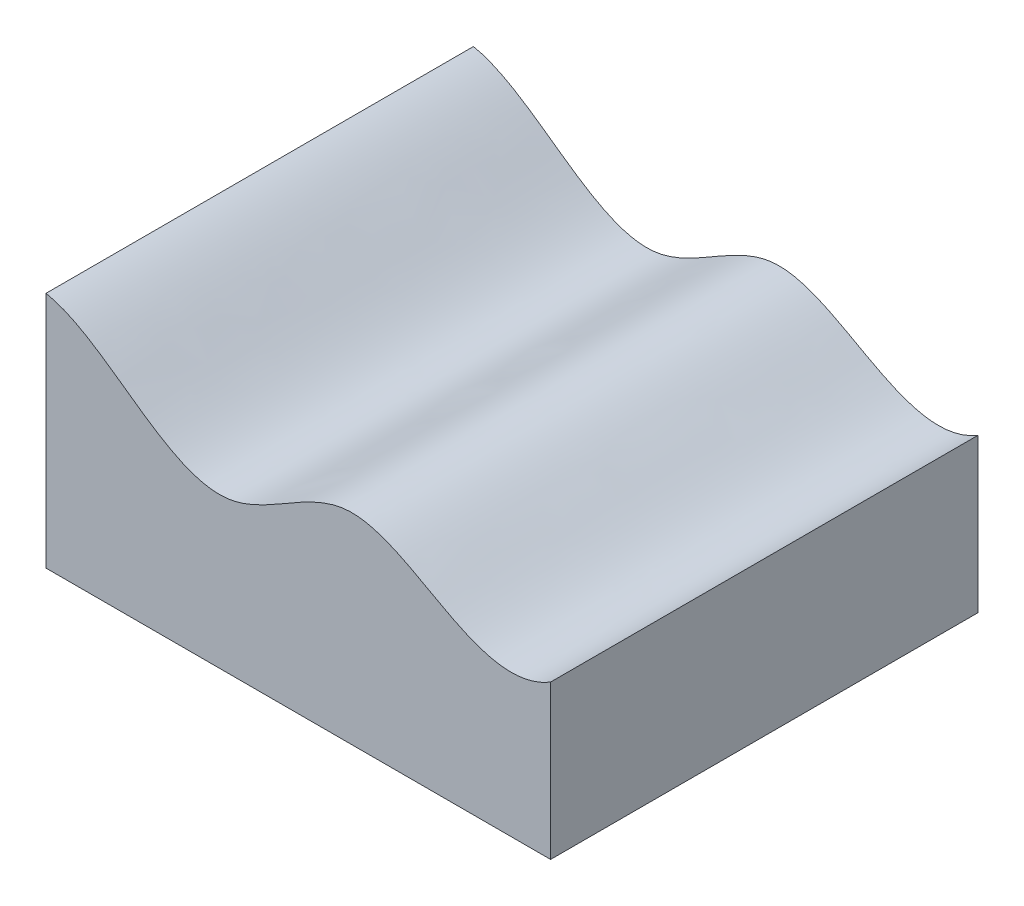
ISO-10303-21;
HEADER;
FILE_DESCRIPTION(('STEP AP214'),'2;1');
FILE_NAME('part.step','',(''),(''),'','','');
FILE_SCHEMA(('AUTOMOTIVE_DESIGN { 1 0 10303 214 1 1 1 1 }'));
ENDSEC;
DATA;
#1=APPLICATION_CONTEXT('core data for automotive mechanical design processes');
#2=APPLICATION_PROTOCOL_DEFINITION('international standard','automotive_design',2000,#1);
#3=PRODUCT_CONTEXT('',#1,'mechanical');
#4=PRODUCT('Part','Part','',(#3));
#5=PRODUCT_RELATED_PRODUCT_CATEGORY('part','',(#4));
#6=PRODUCT_DEFINITION_FORMATION('','',#4);
#7=PRODUCT_DEFINITION_CONTEXT('part definition',#1,'design');
#8=PRODUCT_DEFINITION('design','',#6,#7);
#9=PRODUCT_DEFINITION_SHAPE('','',#8);
#10=(LENGTH_UNIT() NAMED_UNIT(*) SI_UNIT(.MILLI.,.METRE.));
#11=(NAMED_UNIT(*) PLANE_ANGLE_UNIT() SI_UNIT($,.RADIAN.));
#12=(NAMED_UNIT(*) SI_UNIT($,.STERADIAN.) SOLID_ANGLE_UNIT());
#13=UNCERTAINTY_MEASURE_WITH_UNIT(LENGTH_MEASURE(1.E-05),#10,'distance_accuracy_value','');
#14=(GEOMETRIC_REPRESENTATION_CONTEXT(3) GLOBAL_UNCERTAINTY_ASSIGNED_CONTEXT((#13)) GLOBAL_UNIT_ASSIGNED_CONTEXT((#10,
#11,#12)) REPRESENTATION_CONTEXT('',''));
#15=CARTESIAN_POINT('',(0.,0.,0.));
#16=DIRECTION('',(0.,0.,1.));
#17=DIRECTION('',(1.,0.,0.));
#18=AXIS2_PLACEMENT_3D('',#15,#16,#17);
#19=CARTESIAN_POINT('',(94.7449071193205,40.132,80.2493362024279));
#20=DIRECTION('',(-1.,0.,0.));
#21=DIRECTION('',(0.,0.,1.));
#22=AXIS2_PLACEMENT_3D('',#19,#20,#21);
#23=PLANE('',#22);
#24=DIRECTION('',(0.,0.,-1.));
#25=VECTOR('',#24,1.);
#26=CARTESIAN_POINT('',(94.7449071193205,0.,80.2493362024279));
#27=LINE('',#26,#25);
#28=CARTESIAN_POINT('',(94.7449071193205,0.,80.2493362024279));
#29=VERTEX_POINT('',#28);
#30=CARTESIAN_POINT('',(94.7449071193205,0.,-80.2493362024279));
#31=VERTEX_POINT('',#30);
#32=EDGE_CURVE('E175',#29,#31,#27,.T.);
#33=ORIENTED_EDGE('',*,*,#32,.T.);
#34=DIRECTION('',(0.,-1.,0.));
#35=VECTOR('',#34,1.);
#36=CARTESIAN_POINT('',(94.7449071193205,40.132,-80.2493362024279));
#37=LINE('',#36,#35);
#38=CARTESIAN_POINT('',(94.7449071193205,57.7006263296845,-80.249336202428));
#39=VERTEX_POINT('',#38);
#40=EDGE_CURVE('E46',#39,#31,#37,.T.);
#41=ORIENTED_EDGE('',*,*,#40,.F.);
#42=DIRECTION('',(0.,0.,1.));
#43=VECTOR('',#42,1.);
#44=CARTESIAN_POINT('',(94.7449071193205,57.7006263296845,0.));
#45=LINE('',#44,#43);
#46=CARTESIAN_POINT('',(94.7449071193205,57.7006263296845,80.2493362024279));
#47=VERTEX_POINT('',#46);
#48=EDGE_CURVE('E186',#47,#39,#45,.F.);
#49=ORIENTED_EDGE('',*,*,#48,.F.);
#50=DIRECTION('',(0.,-1.,0.));
#51=VECTOR('',#50,1.);
#52=CARTESIAN_POINT('',(94.7449071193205,40.132,80.2493362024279));
#53=LINE('',#52,#51);
#54=EDGE_CURVE('E181',#47,#29,#53,.T.);
#55=ORIENTED_EDGE('',*,*,#54,.T.);
#56=EDGE_LOOP('',(#33,#41,#49,#55));
#57=FACE_BOUND('',#56,.T.);
#58=ADVANCED_FACE('F115',(#57),#23,.F.);
#59=CARTESIAN_POINT('',(-94.7449071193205,40.132,-80.2493362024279));
#60=DIRECTION('',(0.,0.,1.));
#61=DIRECTION('',(1.,0.,0.));
#62=AXIS2_PLACEMENT_3D('',#59,#60,#61);
#63=PLANE('',#62);
#64=DIRECTION('',(-1.,0.,0.));
#65=VECTOR('',#64,1.);
#66=CARTESIAN_POINT('',(-94.7449071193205,0.,-80.2493362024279));
#67=LINE('',#66,#65);
#68=CARTESIAN_POINT('',(-94.7449071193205,0.,-80.2493362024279));
#69=VERTEX_POINT('',#68);
#70=EDGE_CURVE('E172',#31,#69,#67,.T.);
#71=ORIENTED_EDGE('',*,*,#70,.T.);
#72=DIRECTION('',(0.,-1.,0.));
#73=VECTOR('',#72,1.);
#74=CARTESIAN_POINT('',(-94.7449071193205,40.132,-80.2493362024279));
#75=LINE('',#74,#73);
#76=CARTESIAN_POINT('',(-94.7449071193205,89.3816138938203,-80.2493362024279));
#77=VERTEX_POINT('',#76);
#78=EDGE_CURVE('E131',#77,#69,#75,.T.);
#79=ORIENTED_EDGE('',*,*,#78,.F.);
#80=CARTESIAN_POINT('',(94.7449071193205,57.7006263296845,-80.249336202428));
#81=CARTESIAN_POINT('',(94.3993574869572,57.4917980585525,-80.2493362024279));
#82=CARTESIAN_POINT('',(94.0500610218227,57.2891178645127,-80.2493362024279));
#83=CARTESIAN_POINT('',(93.3438109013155,56.8967130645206,-80.2493362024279));
#84=CARTESIAN_POINT('',(92.9868499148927,56.7070016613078,-80.2493362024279));
#85=CARTESIAN_POINT('',(92.2656378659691,56.3415335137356,-80.2493362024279));
#86=CARTESIAN_POINT('',(91.9013835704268,56.1657831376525,-80.2493362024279));
#87=CARTESIAN_POINT('',(91.1660197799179,55.8291502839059,-80.2493362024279));
#88=CARTESIAN_POINT('',(90.794909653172,55.6682691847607,-80.2493362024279));
#89=CARTESIAN_POINT('',(90.0480946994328,55.3629205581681,-80.2493362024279));
#90=CARTESIAN_POINT('',(89.6724209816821,55.2183770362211,-80.2493362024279));
#91=CARTESIAN_POINT('',(88.915323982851,54.9455377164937,-80.2493362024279));
#92=CARTESIAN_POINT('',(88.533902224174,54.8172376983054,-80.2493362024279));
#93=CARTESIAN_POINT('',(87.7658892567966,54.5774577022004,-80.2493362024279));
#94=CARTESIAN_POINT('',(87.3792991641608,54.4659741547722,-80.2493362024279));
#95=CARTESIAN_POINT('',(86.6015900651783,54.260262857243,-80.2493362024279));
#96=CARTESIAN_POINT('',(86.2104713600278,54.166033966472,-80.2493362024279));
#97=CARTESIAN_POINT('',(85.2904999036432,53.9660281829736,-80.2493362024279));
#98=CARTESIAN_POINT('',(84.7601091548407,53.8672498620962,-80.2493362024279));
#99=CARTESIAN_POINT('',(83.6942942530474,53.7015451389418,-80.2493362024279));
#100=CARTESIAN_POINT('',(83.1588691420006,53.63462492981,-80.2493362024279));
#101=CARTESIAN_POINT('',(82.0850421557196,53.5323827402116,-80.2493362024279));
#102=CARTESIAN_POINT('',(81.5466404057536,53.4970594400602,-80.2493362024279));
#103=CARTESIAN_POINT('',(80.4689905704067,53.4572099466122,-80.2493362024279));
#104=CARTESIAN_POINT('',(79.929743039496,53.4526684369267,-80.2493362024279));
#105=CARTESIAN_POINT('',(78.8518225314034,53.4730750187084,-80.2493362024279));
#106=CARTESIAN_POINT('',(78.3131495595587,53.4980233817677,-80.2493362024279));
#107=CARTESIAN_POINT('',(77.237844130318,53.5757752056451,-80.2493362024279));
#108=CARTESIAN_POINT('',(76.7012117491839,53.628579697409,-80.2493362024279));
#109=CARTESIAN_POINT('',(75.3812974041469,53.7909088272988,-80.2493362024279));
#110=CARTESIAN_POINT('',(74.5998360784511,53.9154048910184,-80.2493362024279));
#111=CARTESIAN_POINT('',(73.0461939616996,54.2139366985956,-80.2493362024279));
#112=CARTESIAN_POINT('',(72.2740183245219,54.38799874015,-80.2493362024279));
#113=CARTESIAN_POINT('',(70.7405489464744,54.7791104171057,-80.2493362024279));
#114=CARTESIAN_POINT('',(69.9792576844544,54.9961696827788,-80.2493362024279));
#115=CARTESIAN_POINT('',(68.464937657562,55.4680067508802,-80.2493362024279));
#116=CARTESIAN_POINT('',(67.7119589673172,55.722943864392,-80.2493362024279));
#117=CARTESIAN_POINT('',(66.2176143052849,56.2639200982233,-80.2493362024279));
#118=CARTESIAN_POINT('',(65.476244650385,56.5499491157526,-80.2493362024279));
#119=CARTESIAN_POINT('',(64.0042072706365,57.1479001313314,-80.2493362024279));
#120=CARTESIAN_POINT('',(63.273538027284,57.4598184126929,-80.2493362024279));
#121=CARTESIAN_POINT('',(61.8833356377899,58.0775356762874,-80.2493362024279));
#122=CARTESIAN_POINT('',(61.2230298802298,58.3816057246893,-80.2493362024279));
#123=CARTESIAN_POINT('',(59.9093371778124,59.0043792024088,-80.2493362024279));
#124=CARTESIAN_POINT('',(59.2559505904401,59.3230833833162,-80.2493362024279));
#125=CARTESIAN_POINT('',(57.9547952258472,59.972334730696,-80.2493362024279));
#126=CARTESIAN_POINT('',(57.3070287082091,60.3028864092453,-80.2493362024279));
#127=CARTESIAN_POINT('',(56.0162044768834,60.9730768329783,-80.2493362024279));
#128=CARTESIAN_POINT('',(55.3731468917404,61.3127158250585,-80.2493362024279));
#129=CARTESIAN_POINT('',(53.4487025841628,62.341834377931,-80.2493362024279));
#130=CARTESIAN_POINT('',(52.1726347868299,63.0412152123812,-80.2493362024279));
#131=CARTESIAN_POINT('',(49.6264324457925,64.4472288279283,-80.2493362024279));
#132=CARTESIAN_POINT('',(48.3562928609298,65.1538526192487,-80.2493362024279));
#133=CARTESIAN_POINT('',(46.4473267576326,66.206243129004,-80.2493362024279));
#134=CARTESIAN_POINT('',(45.8105447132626,66.5556925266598,-80.2493362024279));
#135=CARTESIAN_POINT('',(44.5343712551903,67.2497844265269,-80.2493362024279));
#136=CARTESIAN_POINT('',(43.8949798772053,67.594426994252,-80.2493362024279));
#137=CARTESIAN_POINT('',(42.6124840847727,68.276341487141,-80.2493362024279));
#138=CARTESIAN_POINT('',(41.9693807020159,68.6136153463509,-80.2493362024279));
#139=CARTESIAN_POINT('',(40.6780481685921,69.2781847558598,-80.2493362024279));
#140=CARTESIAN_POINT('',(40.0298191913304,69.6054806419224,-80.2493362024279));
#141=CARTESIAN_POINT('',(38.7376149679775,70.2418874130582,-80.2493362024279));
#142=CARTESIAN_POINT('',(38.0937434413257,70.5512081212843,-80.2493362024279));
#143=CARTESIAN_POINT('',(36.7985680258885,71.1542034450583,-80.2493362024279));
#144=CARTESIAN_POINT('',(36.1472630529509,71.4478757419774,-80.2493362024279));
#145=CARTESIAN_POINT('',(34.8361026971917,72.0160044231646,-80.2493362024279));
#146=CARTESIAN_POINT('',(34.1762453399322,72.2904562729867,-80.2493362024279));
#147=CARTESIAN_POINT('',(32.8471130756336,72.816033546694,-80.2493362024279));
#148=CARTESIAN_POINT('',(32.1778365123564,73.0671548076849,-80.2493362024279));
#149=CARTESIAN_POINT('',(30.8294724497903,73.5413367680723,-80.2493362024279));
#150=CARTESIAN_POINT('',(30.1503865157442,73.7644018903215,-80.2493362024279));
#151=CARTESIAN_POINT('',(28.7822518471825,74.1772514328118,-80.2493362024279));
#152=CARTESIAN_POINT('',(28.0932058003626,74.3670446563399,-80.2493362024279));
#153=CARTESIAN_POINT('',(26.8813036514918,74.6645021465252,-80.2493362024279));
#154=CARTESIAN_POINT('',(26.360564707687,74.7807921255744,-80.2493362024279));
#155=CARTESIAN_POINT('',(25.3142051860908,74.989111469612,-80.2493362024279));
#156=CARTESIAN_POINT('',(24.7885845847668,75.0811407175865,-80.2493362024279));
#157=CARTESIAN_POINT('',(23.7332369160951,75.238378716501,-80.2493362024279));
#158=CARTESIAN_POINT('',(23.2035092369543,75.3035833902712,-80.2493362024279));
#159=CARTESIAN_POINT('',(22.1435577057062,75.4044261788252,-80.2493362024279));
#160=CARTESIAN_POINT('',(21.6133466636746,75.4401951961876,-80.2493362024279));
#161=CARTESIAN_POINT('',(20.8172090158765,75.4703608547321,-80.2493362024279));
#162=CARTESIAN_POINT('',(20.5516886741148,75.4765013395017,-80.2493362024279));
#163=CARTESIAN_POINT('',(20.020574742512,75.4807139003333,-80.2493362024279));
#164=CARTESIAN_POINT('',(19.7549811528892,75.4787860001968,-80.2493362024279));
#165=CARTESIAN_POINT('',(19.2241155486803,75.4666456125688,-80.2493362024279));
#166=CARTESIAN_POINT('',(18.9588434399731,75.456437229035,-80.2493362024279));
#167=CARTESIAN_POINT('',(18.4287494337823,75.4275622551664,-80.2493362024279));
#168=CARTESIAN_POINT('',(18.1639275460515,75.4088954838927,-80.2493362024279));
#169=CARTESIAN_POINT('',(17.700865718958,75.3686697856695,-80.2493362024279));
#170=CARTESIAN_POINT('',(17.5024611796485,75.3489874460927,-80.2493362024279));
#171=CARTESIAN_POINT('',(17.1061946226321,75.3047498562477,-80.2493362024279));
#172=CARTESIAN_POINT('',(16.9083326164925,75.2801945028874,-80.2493362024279));
#173=CARTESIAN_POINT('',(16.3156724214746,75.1995141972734,-80.2493362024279));
#174=CARTESIAN_POINT('',(15.9218119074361,75.136376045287,-80.2493362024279));
#175=CARTESIAN_POINT('',(15.1371080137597,74.9928907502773,-80.2493362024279));
#176=CARTESIAN_POINT('',(14.7462659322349,74.9125365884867,-80.2493362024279));
#177=CARTESIAN_POINT('',(13.9681654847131,74.7361714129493,-80.2493362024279));
#178=CARTESIAN_POINT('',(13.5809070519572,74.6401606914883,-80.2493362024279));
#179=CARTESIAN_POINT('',(12.4212253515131,74.3299125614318,-80.2493362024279));
#180=CARTESIAN_POINT('',(11.6545167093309,74.0941474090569,-80.2493362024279));
#181=CARTESIAN_POINT('',(10.1371760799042,73.5767148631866,-80.2493362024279));
#182=CARTESIAN_POINT('',(9.38654207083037,73.2950532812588,-80.2493362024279));
#183=CARTESIAN_POINT('',(8.01585590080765,72.7420769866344,-80.2493362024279));
#184=CARTESIAN_POINT('',(7.39367556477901,72.4759840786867,-80.2493362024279));
#185=CARTESIAN_POINT('',(6.15866031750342,71.9227391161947,-80.2493362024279));
#186=CARTESIAN_POINT('',(5.54582717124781,71.6355831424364,-80.2493362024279));
#187=CARTESIAN_POINT('',(4.32810710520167,71.0444158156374,-80.2493362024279));
#188=CARTESIAN_POINT('',(3.72322324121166,70.7403982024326,-80.2493362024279));
#189=CARTESIAN_POINT('',(2.52019236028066,70.1193047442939,-80.2493362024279));
#190=CARTESIAN_POINT('',(1.9220456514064,69.8022283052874,-80.2493362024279));
#191=CARTESIAN_POINT('',(0.731014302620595,69.1582943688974,-80.2493362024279));
#192=CARTESIAN_POINT('',(0.138129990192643,68.8314362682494,-80.2493362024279));
#193=CARTESIAN_POINT('',(-1.04363947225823,68.1710251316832,-80.2493362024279));
#194=CARTESIAN_POINT('',(-1.63252582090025,67.8374742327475,-80.2493362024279));
#195=CARTESIAN_POINT('',(-2.80790809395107,67.1663596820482,-80.2493362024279));
#196=CARTESIAN_POINT('',(-3.39440428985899,66.828796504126,-80.2493362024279));
#197=CARTESIAN_POINT('',(-4.5665571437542,66.1522398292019,-80.2493362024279));
#198=CARTESIAN_POINT('',(-5.15221381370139,65.8132463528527,-80.2493362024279));
#199=CARTESIAN_POINT('',(-6.27893378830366,65.1625398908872,-80.2493362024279));
#200=CARTESIAN_POINT('',(-6.81994789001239,64.8507419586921,-80.2493362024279));
#201=CARTESIAN_POINT('',(-7.90374103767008,64.2301710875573,-80.2493362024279));
#202=CARTESIAN_POINT('',(-8.44652015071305,63.9213982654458,-80.2493362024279));
#203=CARTESIAN_POINT('',(-9.53506040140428,63.3090206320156,-80.2493362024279));
#204=CARTESIAN_POINT('',(-10.0808218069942,63.0054162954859,-80.2493362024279));
#205=CARTESIAN_POINT('',(-11.1766166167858,62.4056458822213,-80.2493362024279));
#206=CARTESIAN_POINT('',(-11.7266511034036,62.109481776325,-80.2493362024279));
#207=CARTESIAN_POINT('',(-12.8319648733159,61.5272713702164,-80.2493362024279));
#208=CARTESIAN_POINT('',(-13.3872433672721,61.2412235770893,-80.2493362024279));
#209=CARTESIAN_POINT('',(-14.5042872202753,60.6820719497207,-80.2493362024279));
#210=CARTESIAN_POINT('',(-15.0660523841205,60.408967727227,-80.2493362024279));
#211=CARTESIAN_POINT('',(-16.1970504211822,59.8790338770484,-80.2493362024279));
#212=CARTESIAN_POINT('',(-16.766281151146,59.622199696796,-80.2493362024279));
#213=CARTESIAN_POINT('',(-17.9133690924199,59.1284798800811,-80.2493362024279));
#214=CARTESIAN_POINT('',(-18.4912260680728,58.8915936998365,-80.2493362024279));
#215=CARTESIAN_POINT('',(-19.5782050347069,58.4722684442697,-80.2493362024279));
#216=CARTESIAN_POINT('',(-20.0861488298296,58.2867883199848,-80.2493362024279));
#217=CARTESIAN_POINT('',(-21.1093657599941,57.93727256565,-80.2493362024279));
#218=CARTESIAN_POINT('',(-21.6246384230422,57.7732355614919,-80.2493362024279));
#219=CARTESIAN_POINT('',(-22.6625683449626,57.470175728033,-80.2493362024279));
#220=CARTESIAN_POINT('',(-23.1852253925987,57.3311521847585,-80.2493362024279));
#221=CARTESIAN_POINT('',(-23.9730667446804,57.1446335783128,-80.2493362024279));
#222=CARTESIAN_POINT('',(-24.2356975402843,57.086242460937,-80.2493362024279));
#223=CARTESIAN_POINT('',(-24.7625581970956,56.9771365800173,-80.2493362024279));
#224=CARTESIAN_POINT('',(-25.0267880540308,56.9264217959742,-80.2493362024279));
#225=CARTESIAN_POINT('',(-25.5566877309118,56.8331673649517,-80.2493362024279));
#226=CARTESIAN_POINT('',(-25.8223575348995,56.7906276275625,-80.2493362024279));
#227=CARTESIAN_POINT('',(-26.3549513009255,56.7142901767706,-80.2493362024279));
#228=CARTESIAN_POINT('',(-26.6218752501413,56.6804923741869,-80.2493362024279));
#229=CARTESIAN_POINT('',(-27.1566439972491,56.6218239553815,-80.2493362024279));
#230=CARTESIAN_POINT('',(-27.4244885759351,56.596951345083,-80.2493362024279));
#231=CARTESIAN_POINT('',(-27.9608423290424,56.556013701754,-80.2493362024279));
#232=CARTESIAN_POINT('',(-28.2293515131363,56.5399487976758,-80.2493362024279));
#233=CARTESIAN_POINT('',(-29.0383274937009,56.5047120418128,-80.2493362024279));
#234=CARTESIAN_POINT('',(-29.5794275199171,56.4988049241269,-80.2493362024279));
#235=CARTESIAN_POINT('',(-30.6610772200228,56.5209209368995,-80.2493362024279));
#236=CARTESIAN_POINT('',(-31.201626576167,56.5489580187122,-80.2493362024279));
#237=CARTESIAN_POINT('',(-32.2801140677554,56.6371125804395,-80.2493362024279));
#238=CARTESIAN_POINT('',(-32.818052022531,56.6972322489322,-80.2493362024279));
#239=CARTESIAN_POINT('',(-33.8921825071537,56.847676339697,-80.2493362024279));
#240=CARTESIAN_POINT('',(-34.4283554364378,56.9381392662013,-80.2493362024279));
#241=CARTESIAN_POINT('',(-35.4951609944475,57.1467266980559,-80.2493362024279));
#242=CARTESIAN_POINT('',(-36.0257945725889,57.2648463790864,-80.2493362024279));
#243=CARTESIAN_POINT('',(-37.0807402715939,57.5262289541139,-80.2493362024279));
#244=CARTESIAN_POINT('',(-37.6050528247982,57.6694901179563,-80.2493362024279));
#245=CARTESIAN_POINT('',(-38.9441273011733,58.0669051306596,-80.2493362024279));
#246=CARTESIAN_POINT('',(-39.7539696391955,58.3377006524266,-80.2493362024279));
#247=CARTESIAN_POINT('',(-41.3568722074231,58.926506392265,-80.2493362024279));
#248=CARTESIAN_POINT('',(-42.149917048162,59.2445579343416,-80.2493362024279));
#249=CARTESIAN_POINT('',(-43.7199616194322,59.9202077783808,-80.2493362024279));
#250=CARTESIAN_POINT('',(-44.4969416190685,60.2778516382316,-80.2493362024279));
#251=CARTESIAN_POINT('',(-46.0351957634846,61.0256407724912,-80.2493362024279));
#252=CARTESIAN_POINT('',(-46.7964666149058,61.4157927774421,-80.2493362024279));
#253=CARTESIAN_POINT('',(-48.3109118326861,62.226081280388,-80.2493362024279));
#254=CARTESIAN_POINT('',(-49.0639672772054,62.6464389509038,-80.2493362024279));
#255=CARTESIAN_POINT('',(-50.5566040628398,63.508831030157,-80.2493362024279));
#256=CARTESIAN_POINT('',(-51.2961968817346,63.9508456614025,-80.2493362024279));
#257=CARTESIAN_POINT('',(-52.7640616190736,64.8523999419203,-80.2493362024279));
#258=CARTESIAN_POINT('',(-53.4923391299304,65.3119305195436,-80.2493362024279));
#259=CARTESIAN_POINT('',(-54.9394355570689,66.244824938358,-80.2493362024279));
#260=CARTESIAN_POINT('',(-55.658259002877,66.7181817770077,-80.2493362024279));
#261=CARTESIAN_POINT('',(-57.2492099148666,67.7832254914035,-80.2493362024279));
#262=CARTESIAN_POINT('',(-58.1195214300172,68.3776180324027,-80.2493362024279));
#263=CARTESIAN_POINT('',(-59.852309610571,69.5772943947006,-80.2493362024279));
#264=CARTESIAN_POINT('',(-60.7147878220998,70.1825759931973,-80.2493362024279));
#265=CARTESIAN_POINT('',(-62.4355889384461,71.3996652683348,-80.2493362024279));
#266=CARTESIAN_POINT('',(-63.2939101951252,72.0114752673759,-80.2493362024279));
#267=CARTESIAN_POINT('',(-65.0099265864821,73.2374517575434,-80.2493362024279));
#268=CARTESIAN_POINT('',(-65.867620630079,73.8516197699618,-80.2493362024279));
#269=CARTESIAN_POINT('',(-67.5858982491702,75.0781638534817,-80.2493362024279));
#270=CARTESIAN_POINT('',(-68.4464840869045,75.6905367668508,-80.2493362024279));
#271=CARTESIAN_POINT('',(-70.1741770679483,76.9091809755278,-80.2493362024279));
#272=CARTESIAN_POINT('',(-71.0412928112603,77.5154401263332,-80.2493362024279));
#273=CARTESIAN_POINT('',(-72.7676340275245,78.7045787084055,-80.2493362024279));
#274=CARTESIAN_POINT('',(-73.6267037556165,79.2876833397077,-80.2493362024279));
#275=CARTESIAN_POINT('',(-75.3564559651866,80.4370203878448,-80.2493362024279));
#276=CARTESIAN_POINT('',(-76.2271416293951,81.0032480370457,-80.2493362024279));
#277=CARTESIAN_POINT('',(-77.9822796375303,82.1117818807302,-80.2493362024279));
#278=CARTESIAN_POINT('',(-78.8667149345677,82.6541149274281,-80.2493362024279));
#279=CARTESIAN_POINT('',(-80.6520100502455,83.7070018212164,-80.2493362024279));
#280=CARTESIAN_POINT('',(-81.5528328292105,84.2176180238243,-80.2493362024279));
#281=CARTESIAN_POINT('',(-83.3741557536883,85.1980938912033,-80.2493362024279));
#282=CARTESIAN_POINT('',(-84.2946122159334,85.6680342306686,-80.2493362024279));
#283=CARTESIAN_POINT('',(-86.1595930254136,86.5567936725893,-80.2493362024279));
#284=CARTESIAN_POINT('',(-87.1041018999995,86.9756446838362,-80.2493362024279));
#285=CARTESIAN_POINT('',(-88.3301808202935,87.4702808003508,-80.2493362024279));
#286=CARTESIAN_POINT('',(-88.5997697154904,87.5760664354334,-80.2493362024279));
#287=CARTESIAN_POINT('',(-89.1411173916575,87.7821912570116,-80.2493362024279));
#288=CARTESIAN_POINT('',(-89.4128767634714,87.8825288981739,-80.2493362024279));
#289=CARTESIAN_POINT('',(-89.9585070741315,88.0773626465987,-80.2493362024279));
#290=CARTESIAN_POINT('',(-90.232378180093,88.1718582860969,-80.2493362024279));
#291=CARTESIAN_POINT('',(-90.7821855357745,88.3546068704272,-80.2493362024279));
#292=CARTESIAN_POINT('',(-91.058121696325,88.4428600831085,-80.2493362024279));
#293=CARTESIAN_POINT('',(-91.6151986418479,88.6136939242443,-80.2493362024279));
#294=CARTESIAN_POINT('',(-91.8963628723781,88.6961982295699,-80.2493362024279));
#295=CARTESIAN_POINT('',(-92.4607188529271,88.8539784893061,-80.2493362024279));
#296=CARTESIAN_POINT('',(-92.7439106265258,88.9292543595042,-80.2493362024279));
#297=CARTESIAN_POINT('',(-93.3122874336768,89.0721460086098,-80.2493362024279));
#298=CARTESIAN_POINT('',(-93.5974728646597,89.139760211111,-80.2493362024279));
#299=CARTESIAN_POINT('',(-94.169794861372,89.2668894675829,-80.2493362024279));
#300=CARTESIAN_POINT('',(-94.4569323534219,89.3264003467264,-80.2493362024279));
#301=CARTESIAN_POINT('',(-94.7449071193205,89.3816138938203,-80.2493362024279));
#302=B_SPLINE_CURVE_WITH_KNOTS('',3,(#80,#81,#82,#83,#84,#85,#86,#87,#88,#89,#90,#91,#92,#93,
#94,#95,#96,#97,#98,#99,#100,#101,#102,#103,#104,#105,#106,#107,#108,#109,#110,#111,#112,#113,
#114,#115,#116,#117,#118,#119,#120,#121,#122,#123,#124,#125,#126,#127,#128,#129,#130,#131,#132,
#133,#134,#135,#136,#137,#138,#139,#140,#141,#142,#143,#144,#145,#146,#147,#148,#149,#150,#151,
#152,#153,#154,#155,#156,#157,#158,#159,#160,#161,#162,#163,#164,#165,#166,#167,#168,#169,#170,
#171,#172,#173,#174,#175,#176,#177,#178,#179,#180,#181,#182,#183,#184,#185,#186,#187,#188,#189,
#190,#191,#192,#193,#194,#195,#196,#197,#198,#199,#200,#201,#202,#203,#204,#205,#206,#207,#208,
#209,#210,#211,#212,#213,#214,#215,#216,#217,#218,#219,#220,#221,#222,#223,#224,#225,#226,#227,
#228,#229,#230,#231,#232,#233,#234,#235,#236,#237,#238,#239,#240,#241,#242,#243,#244,#245,#246,
#247,#248,#249,#250,#251,#252,#253,#254,#255,#256,#257,#258,#259,#260,#261,#262,#263,#264,#265,
#266,#267,#268,#269,#270,#271,#272,#273,#274,#275,#276,#277,#278,#279,#280,#281,#282,#283,#284,
#285,#286,#287,#288,#289,#290,#291,#292,#293,#294,#295,#296,#297,#298,#299,#300,#301),
.UNSPECIFIED.,.F.,.F.,(4,2,2,2,2,2,2,2,2,2,2,2,2,2,2,2,2,2,2,2,2,2,2,2,2,2,2,2,2,2,2,2,2,2,2,2,
2,2,2,2,2,2,2,2,2,2,2,2,2,2,2,2,2,2,2,2,2,2,2,2,2,2,2,2,2,2,2,2,2,2,2,2,2,2,2,2,2,2,2,2,2,2,2,2,
2,2,2,2,2,2,2,2,2,2,2,2,2,2,2,2,2,2,2,2,2,2,2,2,2,2,4),(0.,1.21122475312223,2.42366476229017,
3.63665468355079,4.84975694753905,6.05696153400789,7.26385181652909,8.47048555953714,
9.67703950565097,11.2945567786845,12.9123883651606,14.5301523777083,16.1471113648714,
17.7640852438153,19.3811189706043,21.7531319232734,24.1264057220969,26.5002116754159,
28.8843001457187,31.2676162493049,33.6505907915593,35.8312430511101,38.0120074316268,
40.1936113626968,42.3752746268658,46.7405880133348,51.1010170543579,53.2800983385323,
55.4591498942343,57.6376224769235,59.8160216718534,61.9588063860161,64.1019077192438,
66.2455129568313,68.3894999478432,70.5331485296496,72.6762290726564,74.2764290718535,
75.876636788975,77.4770876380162,79.0703821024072,79.8670549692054,80.6637254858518,
81.4600013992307,82.2562943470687,82.8543703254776,83.4524589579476,84.6486718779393,
85.8453734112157,87.0420526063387,89.4464391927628,91.8505215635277,93.8801443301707,
95.9101457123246,97.940905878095,99.9717585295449,102.002736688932,104.033076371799,
106.063178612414,108.093251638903,109.966541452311,111.839903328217,113.713436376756,
115.587460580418,117.461207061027,119.334897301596,121.208060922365,123.081173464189,
124.70301335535,126.324749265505,127.946438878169,128.753475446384,129.560509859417,
130.367535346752,131.174552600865,131.981389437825,132.788238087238,134.41041462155,
136.033258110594,137.656212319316,139.286677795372,140.916859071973,142.546928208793,
145.106807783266,147.668939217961,150.234050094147,152.799693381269,155.386541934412,
157.971070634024,160.554278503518,163.136200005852,166.297821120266,169.458804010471,
172.620951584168,175.785692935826,178.954350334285,182.128395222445,185.243076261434,
188.358628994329,191.470586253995,194.576217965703,197.675541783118,200.772919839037,
201.641680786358,202.510686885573,203.37976247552,204.248800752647,205.127767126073,
206.00674373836,206.885900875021,207.765509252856),.UNSPECIFIED.);
#303=EDGE_CURVE('E121',#39,#77,#302,.T.);
#304=ORIENTED_EDGE('',*,*,#303,.F.);
#305=ORIENTED_EDGE('',*,*,#40,.T.);
#306=EDGE_LOOP('',(#71,#79,#304,#305));
#307=FACE_BOUND('',#306,.T.);
#308=ADVANCED_FACE('F178',(#307),#63,.F.);
#309=CARTESIAN_POINT('',(-94.7449071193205,40.132,80.2493362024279));
#310=DIRECTION('',(1.,0.,0.));
#311=DIRECTION('',(0.,0.,-1.));
#312=AXIS2_PLACEMENT_3D('',#309,#310,#311);
#313=PLANE('',#312);
#314=DIRECTION('',(0.,0.,1.));
#315=VECTOR('',#314,1.);
#316=CARTESIAN_POINT('',(-94.7449071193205,0.,80.2493362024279));
#317=LINE('',#316,#315);
#318=CARTESIAN_POINT('',(-94.7449071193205,0.,80.2493362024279));
#319=VERTEX_POINT('',#318);
#320=EDGE_CURVE('E164',#69,#319,#317,.T.);
#321=ORIENTED_EDGE('',*,*,#320,.T.);
#322=DIRECTION('',(0.,-1.,0.));
#323=VECTOR('',#322,1.);
#324=CARTESIAN_POINT('',(-94.7449071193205,40.132,80.2493362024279));
#325=LINE('',#324,#323);
#326=CARTESIAN_POINT('',(-94.7449071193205,89.3816138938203,80.2493362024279));
#327=VERTEX_POINT('',#326);
#328=EDGE_CURVE('E188',#327,#319,#325,.T.);
#329=ORIENTED_EDGE('',*,*,#328,.F.);
#330=DIRECTION('',(0.,0.,1.));
#331=VECTOR('',#330,1.);
#332=CARTESIAN_POINT('',(-94.7449071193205,89.3816138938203,0.));
#333=LINE('',#332,#331);
#334=EDGE_CURVE('E196',#77,#327,#333,.T.);
#335=ORIENTED_EDGE('',*,*,#334,.F.);
#336=ORIENTED_EDGE('',*,*,#78,.T.);
#337=EDGE_LOOP('',(#321,#329,#335,#336));
#338=FACE_BOUND('',#337,.T.);
#339=ADVANCED_FACE('F205',(#338),#313,.F.);
#340=CARTESIAN_POINT('',(-94.7449071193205,40.132,80.2493362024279));
#341=DIRECTION('',(0.,0.,-1.));
#342=DIRECTION('',(-1.,0.,0.));
#343=AXIS2_PLACEMENT_3D('',#340,#341,#342);
#344=PLANE('',#343);
#345=DIRECTION('',(1.,0.,0.));
#346=VECTOR('',#345,1.);
#347=CARTESIAN_POINT('',(-94.7449071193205,0.,80.2493362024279));
#348=LINE('',#347,#346);
#349=EDGE_CURVE('E156',#319,#29,#348,.T.);
#350=ORIENTED_EDGE('',*,*,#349,.T.);
#351=ORIENTED_EDGE('',*,*,#54,.F.);
#352=CARTESIAN_POINT('',(-94.7449071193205,89.3816138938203,80.2493362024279));
#353=CARTESIAN_POINT('',(-94.0273445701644,89.2440096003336,80.2493362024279));
#354=CARTESIAN_POINT('',(-93.3153451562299,89.0798504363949,80.2493362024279));
#355=CARTESIAN_POINT('',(-91.9093643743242,88.7067186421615,80.2493362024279));
#356=CARTESIAN_POINT('',(-91.2152831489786,88.4981244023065,80.2493362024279));
#357=CARTESIAN_POINT('',(-89.843124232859,88.0428991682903,80.2493362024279));
#358=CARTESIAN_POINT('',(-89.1649914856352,87.7964319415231,80.2493362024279));
#359=CARTESIAN_POINT('',(-87.8227700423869,87.2710415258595,80.2493362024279));
#360=CARTESIAN_POINT('',(-87.1586602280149,86.9921719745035,80.2493362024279));
#361=CARTESIAN_POINT('',(-85.8429021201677,86.4067557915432,80.2493362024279));
#362=CARTESIAN_POINT('',(-85.1912526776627,86.1002117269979,80.2493362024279));
#363=CARTESIAN_POINT('',(-83.910893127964,85.4694147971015,80.2493362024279));
#364=CARTESIAN_POINT('',(-83.2819811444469,85.1455697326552,80.2493362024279));
#365=CARTESIAN_POINT('',(-82.0335151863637,84.4785116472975,80.2493362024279));
#366=CARTESIAN_POINT('',(-81.4139742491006,84.1352743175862,80.2493362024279));
#367=CARTESIAN_POINT('',(-80.1833051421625,83.4324943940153,80.2493362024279));
#368=CARTESIAN_POINT('',(-79.572187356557,83.0729336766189,80.2493362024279));
#369=CARTESIAN_POINT('',(-78.3575770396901,82.3403036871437,80.2493362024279));
#370=CARTESIAN_POINT('',(-77.7540897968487,81.9672256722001,80.2493362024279));
#371=CARTESIAN_POINT('',(-76.5540847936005,81.210142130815,80.2493362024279));
#372=CARTESIAN_POINT('',(-75.95756656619,80.8261373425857,80.2493362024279));
#373=CARTESIAN_POINT('',(-74.5224318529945,79.8869961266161,80.2493362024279));
#374=CARTESIAN_POINT('',(-73.6867572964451,79.3273706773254,80.2493362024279));
#375=CARTESIAN_POINT('',(-72.0247696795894,78.1958279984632,80.2493362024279));
#376=CARTESIAN_POINT('',(-71.1984498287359,77.6239206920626,80.2493362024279));
#377=CARTESIAN_POINT('',(-69.5518413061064,76.4720122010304,80.2493362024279));
#378=CARTESIAN_POINT('',(-68.7315509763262,75.8920133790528,80.2493362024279));
#379=CARTESIAN_POINT('',(-67.0939179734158,74.72779585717,80.2493362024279));
#380=CARTESIAN_POINT('',(-66.2765754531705,74.1435769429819,80.2493362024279));
#381=CARTESIAN_POINT('',(-64.6372774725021,72.9713245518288,80.2493362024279));
#382=CARTESIAN_POINT('',(-63.8153234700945,72.3832890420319,80.2493362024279));
#383=CARTESIAN_POINT('',(-62.1688030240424,71.210685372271,80.2493362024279));
#384=CARTESIAN_POINT('',(-61.3442363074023,70.626117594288,80.2493362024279));
#385=CARTESIAN_POINT('',(-59.6898271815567,69.464540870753,80.2493362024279));
#386=CARTESIAN_POINT('',(-58.8599849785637,68.8875316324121,80.2493362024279));
#387=CARTESIAN_POINT('',(-57.1921993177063,67.7453735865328,80.2493362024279));
#388=CARTESIAN_POINT('',(-56.35425625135,67.1802242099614,80.2493362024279));
#389=CARTESIAN_POINT('',(-54.8707004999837,66.200832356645,80.2493362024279));
#390=CARTESIAN_POINT('',(-54.2274243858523,65.7830570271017,80.2493362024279));
#391=CARTESIAN_POINT('',(-52.9332100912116,64.959472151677,80.2493362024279));
#392=CARTESIAN_POINT('',(-52.2822716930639,64.5536629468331,80.2493362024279));
#393=CARTESIAN_POINT('',(-50.971349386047,63.7566456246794,80.2493362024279));
#394=CARTESIAN_POINT('',(-50.3113640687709,63.3654398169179,80.2493362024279));
#395=CARTESIAN_POINT('',(-48.9807812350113,62.6005572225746,80.2493362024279));
#396=CARTESIAN_POINT('',(-48.310177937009,62.2268904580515,80.2493362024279));
#397=CARTESIAN_POINT('',(-46.959060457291,61.5017271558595,80.2493362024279));
#398=CARTESIAN_POINT('',(-46.2785730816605,61.1501808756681,80.2493362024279));
#399=CARTESIAN_POINT('',(-44.9050720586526,60.4724213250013,80.2493362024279));
#400=CARTESIAN_POINT('',(-44.2120589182,60.1462070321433,80.2493362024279));
#401=CARTESIAN_POINT('',(-42.8130742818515,59.5240578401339,80.2493362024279));
#402=CARTESIAN_POINT('',(-42.1071121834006,59.2281019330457,80.2493362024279));
#403=CARTESIAN_POINT('',(-40.6816279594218,58.6718060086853,80.2493362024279));
#404=CARTESIAN_POINT('',(-39.962113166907,58.4114473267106,80.2493362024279));
#405=CARTESIAN_POINT('',(-38.4463889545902,57.9115660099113,80.2493362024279));
#406=CARTESIAN_POINT('',(-37.6489299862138,57.6757950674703,80.2493362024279));
#407=CARTESIAN_POINT('',(-36.0388117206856,57.2619787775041,80.2493362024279));
#408=CARTESIAN_POINT('',(-35.2261516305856,57.0839364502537,80.2493362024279));
#409=CARTESIAN_POINT('',(-34.000554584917,56.8673442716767,80.2493362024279));
#410=CARTESIAN_POINT('',(-33.5919699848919,56.8036573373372,80.2493362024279));
#411=CARTESIAN_POINT('',(-32.7724629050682,56.6938598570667,80.2493362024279));
#412=CARTESIAN_POINT('',(-32.3615407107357,56.6477472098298,80.2493362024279));
#413=CARTESIAN_POINT('',(-31.5380709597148,56.5740917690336,80.2493362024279));
#414=CARTESIAN_POINT('',(-31.1255235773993,56.5465470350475,80.2493362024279));
#415=CARTESIAN_POINT('',(-30.2996304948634,56.5108985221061,80.2493362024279));
#416=CARTESIAN_POINT('',(-29.8862849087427,56.5027921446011,80.2493362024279));
#417=CARTESIAN_POINT('',(-29.0561271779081,56.5067510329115,80.2493362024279));
#418=CARTESIAN_POINT('',(-28.6393158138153,56.5189904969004,80.2493362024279));
#419=CARTESIAN_POINT('',(-27.8067550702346,56.5645141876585,80.2493362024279));
#420=CARTESIAN_POINT('',(-27.3910058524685,56.5978014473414,80.2493362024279));
#421=CARTESIAN_POINT('',(-26.7691084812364,56.6637384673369,80.2493362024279));
#422=CARTESIAN_POINT('',(-26.5620849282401,56.6883870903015,80.2493362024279));
#423=CARTESIAN_POINT('',(-26.1487428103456,56.7430164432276,80.2493362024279));
#424=CARTESIAN_POINT('',(-25.9424242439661,56.7729971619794,80.2493362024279));
#425=CARTESIAN_POINT('',(-25.3247558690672,56.8705576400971,80.2493362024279));
#426=CARTESIAN_POINT('',(-24.9145932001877,56.9457665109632,80.2493362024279));
#427=CARTESIAN_POINT('',(-24.0964827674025,57.1149591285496,80.2493362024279));
#428=CARTESIAN_POINT('',(-23.6885505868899,57.2090173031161,80.2493362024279));
#429=CARTESIAN_POINT('',(-22.8768869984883,57.413835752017,80.2493362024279));
#430=CARTESIAN_POINT('',(-22.4731559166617,57.5245973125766,80.2493362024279));
#431=CARTESIAN_POINT('',(-21.6700094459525,57.7610466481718,80.2493362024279));
#432=CARTESIAN_POINT('',(-21.27059506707,57.8867378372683,80.2493362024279));
#433=CARTESIAN_POINT('',(-20.4762169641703,58.1513415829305,80.2493362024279));
#434=CARTESIAN_POINT('',(-20.0812529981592,58.2902534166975,80.2493362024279));
#435=CARTESIAN_POINT('',(-19.0954043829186,58.6535455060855,80.2493362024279));
#436=CARTESIAN_POINT('',(-18.5072719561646,58.8853995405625,80.2493362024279));
#437=CARTESIAN_POINT('',(-17.3401907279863,59.3709619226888,80.2493362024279));
#438=CARTESIAN_POINT('',(-16.7612418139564,59.6246700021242,80.2493362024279));
#439=CARTESIAN_POINT('',(-15.6112084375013,60.1500042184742,80.2493362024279));
#440=CARTESIAN_POINT('',(-15.0401281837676,60.4216395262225,80.2493362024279));
#441=CARTESIAN_POINT('',(-13.9047463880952,60.9792943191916,80.2493362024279));
#442=CARTESIAN_POINT('',(-13.3404480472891,61.2653202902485,80.2493362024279));
#443=CARTESIAN_POINT('',(-12.2176906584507,61.8485449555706,80.2493362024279));
#444=CARTESIAN_POINT('',(-11.6592315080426,62.1457434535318,80.2493362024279));
#445=CARTESIAN_POINT('',(-10.5426866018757,62.7508645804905,80.2493362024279));
#446=CARTESIAN_POINT('',(-9.98463577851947,63.058851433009,80.2493362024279));
#447=CARTESIAN_POINT('',(-8.87220377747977,63.6807079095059,80.2493362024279));
#448=CARTESIAN_POINT('',(-8.31782088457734,63.9945744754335,80.2493362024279));
#449=CARTESIAN_POINT('',(-7.2113468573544,64.6259150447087,80.2493362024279));
#450=CARTESIAN_POINT('',(-6.65925506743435,64.9433879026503,80.2493362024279));
#451=CARTESIAN_POINT('',(-5.55604481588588,65.5797678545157,80.2493362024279));
#452=CARTESIAN_POINT('',(-5.00492618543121,65.8986746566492,80.2493362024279));
#453=CARTESIAN_POINT('',(-3.90237096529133,66.5357960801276,80.2493362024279));
#454=CARTESIAN_POINT('',(-3.35093441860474,66.8540107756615,80.2493362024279));
#455=CARTESIAN_POINT('',(-2.24481307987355,67.4885551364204,80.2493362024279));
#456=CARTESIAN_POINT('',(-1.6901235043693,67.804876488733,80.2493362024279));
#457=CARTESIAN_POINT('',(-0.577828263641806,68.4324459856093,80.2493362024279));
#458=CARTESIAN_POINT('',(-0.0202224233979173,68.7436938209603,80.2493362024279));
#459=CARTESIAN_POINT('',(1.09926403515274,69.3587729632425,80.2493362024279));
#460=CARTESIAN_POINT('',(1.66114570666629,69.6626023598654,80.2493362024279));
#461=CARTESIAN_POINT('',(2.79063752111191,70.2603277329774,80.2493362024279));
#462=CARTESIAN_POINT('',(3.35825102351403,70.5542173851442,80.2493362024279));
#463=CARTESIAN_POINT('',(4.5007958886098,71.1293012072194,80.2493362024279));
#464=CARTESIAN_POINT('',(5.07573554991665,71.4104789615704,80.2493362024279));
#465=CARTESIAN_POINT('',(6.2255237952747,71.9527105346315,80.2493362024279));
#466=CARTESIAN_POINT('',(6.80026737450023,72.2139859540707,80.2493362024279));
#467=CARTESIAN_POINT('',(7.95841471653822,72.7169608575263,80.2493362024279));
#468=CARTESIAN_POINT('',(8.54181985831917,72.9586571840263,80.2493362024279));
#469=CARTESIAN_POINT('',(9.71737811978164,73.4180005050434,80.2493362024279));
#470=CARTESIAN_POINT('',(10.30952134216,73.6356726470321,80.2493362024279));
#471=CARTESIAN_POINT('',(11.5027309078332,74.0421976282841,80.2493362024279));
#472=CARTESIAN_POINT('',(12.1037831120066,74.2310916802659,80.2493362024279));
#473=CARTESIAN_POINT('',(13.3151835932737,74.5749786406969,80.2493362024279));
#474=CARTESIAN_POINT('',(13.9255247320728,74.729996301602,80.249336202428));
#475=CARTESIAN_POINT('',(14.9218040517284,74.9491700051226,80.2493362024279));
#476=CARTESIAN_POINT('',(15.3050855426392,75.0254917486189,80.2493362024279));
#477=CARTESIAN_POINT('',(16.0747033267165,75.161456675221,80.2493362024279));
#478=CARTESIAN_POINT('',(16.4610400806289,75.2210972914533,80.2493362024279));
#479=CARTESIAN_POINT('',(17.0422694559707,75.2969490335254,80.2493362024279));
#480=CARTESIAN_POINT('',(17.2362917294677,75.3199640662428,80.2493362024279));
#481=CARTESIAN_POINT('',(17.6248357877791,75.3612965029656,80.2493362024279));
#482=CARTESIAN_POINT('',(17.8193575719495,75.379613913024,80.2493362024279));
#483=CARTESIAN_POINT('',(18.4034210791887,75.4275831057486,80.2493362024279));
#484=CARTESIAN_POINT('',(18.7935559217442,75.4502642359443,80.2493362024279));
#485=CARTESIAN_POINT('',(19.5748339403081,75.4775358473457,80.2493362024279));
#486=CARTESIAN_POINT('',(19.9659777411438,75.4821076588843,80.2493362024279));
#487=CARTESIAN_POINT('',(20.7481913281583,75.47378999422,80.2493362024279));
#488=CARTESIAN_POINT('',(21.1392610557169,75.4608952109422,80.2493362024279));
#489=CARTESIAN_POINT('',(21.920598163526,75.4184414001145,80.2493362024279));
#490=CARTESIAN_POINT('',(22.3108652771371,75.3888775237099,80.2493362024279));
#491=CARTESIAN_POINT('',(23.0898705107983,75.3139983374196,80.2493362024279));
#492=CARTESIAN_POINT('',(23.4786086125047,75.2686828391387,80.2493362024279));
#493=CARTESIAN_POINT('',(24.4284453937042,75.1395688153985,80.2493362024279));
#494=CARTESIAN_POINT('',(24.9884469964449,75.0476285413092,80.2493362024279));
#495=CARTESIAN_POINT('',(26.103130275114,74.8357599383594,80.2493362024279));
#496=CARTESIAN_POINT('',(26.6578112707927,74.7158280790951,80.2493362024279));
#497=CARTESIAN_POINT('',(27.7613653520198,74.450989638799,80.2493362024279));
#498=CARTESIAN_POINT('',(28.3102361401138,74.3060735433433,80.2493362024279));
#499=CARTESIAN_POINT('',(29.4016323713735,73.9942291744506,80.2493362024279));
#500=CARTESIAN_POINT('',(29.9441579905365,73.8273015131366,80.2493362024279));
#501=CARTESIAN_POINT('',(31.0257478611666,73.4732129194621,80.2493362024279));
#502=CARTESIAN_POINT('',(31.5647780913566,73.2859485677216,80.2493362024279));
#503=CARTESIAN_POINT('',(32.6364358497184,72.8945299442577,80.2493362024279));
#504=CARTESIAN_POINT('',(33.1690654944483,72.6903814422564,80.2493362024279));
#505=CARTESIAN_POINT('',(34.2284263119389,72.2674529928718,80.2493362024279));
#506=CARTESIAN_POINT('',(34.7551578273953,72.0486739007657,80.2493362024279));
#507=CARTESIAN_POINT('',(35.803155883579,71.5985728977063,80.2493362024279));
#508=CARTESIAN_POINT('',(36.3244229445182,71.3672521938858,80.2493362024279));
#509=CARTESIAN_POINT('',(37.4344818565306,70.8608933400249,80.2493362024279));
#510=CARTESIAN_POINT('',(38.0225442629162,70.584259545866,80.2493362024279));
#511=CARTESIAN_POINT('',(39.1931865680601,70.019599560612,80.2493362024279));
#512=CARTESIAN_POINT('',(39.7757662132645,69.7315728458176,80.2493362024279));
#513=CARTESIAN_POINT('',(40.9364387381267,69.1463095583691,80.2493362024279));
#514=CARTESIAN_POINT('',(41.5145305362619,68.849070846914,80.2493362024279));
#515=CARTESIAN_POINT('',(42.6670026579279,68.2474720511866,80.2493362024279));
#516=CARTESIAN_POINT('',(43.2413829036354,67.9431118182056,80.2493362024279));
#517=CARTESIAN_POINT('',(44.9606353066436,67.0220203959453,80.2493362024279));
#518=CARTESIAN_POINT('',(46.1012909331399,66.3974466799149,80.2493362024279));
#519=CARTESIAN_POINT('',(48.3780281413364,65.1413675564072,80.2493362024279));
#520=CARTESIAN_POINT('',(49.5141116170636,64.5098655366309,80.2493362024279));
#521=CARTESIAN_POINT('',(51.7889592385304,63.2525871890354,80.2493362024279));
#522=CARTESIAN_POINT('',(52.9277223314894,62.6268089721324,80.2493362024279));
#523=CARTESIAN_POINT('',(55.2151257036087,61.393746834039,80.2493362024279));
#524=CARTESIAN_POINT('',(56.3637645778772,60.7864603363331,80.2493362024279));
#525=CARTESIAN_POINT('',(58.3496907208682,59.772029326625,80.2493362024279));
#526=CARTESIAN_POINT('',(59.1829100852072,59.3569609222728,80.2493362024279));
#527=CARTESIAN_POINT('',(60.8603964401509,58.5493535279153,80.2493362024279));
#528=CARTESIAN_POINT('',(61.7046648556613,58.1568174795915,80.2493362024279));
#529=CARTESIAN_POINT('',(63.4066310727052,57.4007895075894,80.2493362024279));
#530=CARTESIAN_POINT('',(64.2643344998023,57.0373101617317,80.2493362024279));
#531=CARTESIAN_POINT('',(65.9921601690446,56.3481324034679,80.2493362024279));
#532=CARTESIAN_POINT('',(66.862241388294,56.0223320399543,80.2493362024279));
#533=CARTESIAN_POINT('',(68.6178792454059,55.4160616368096,80.2493362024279));
#534=CARTESIAN_POINT('',(69.5034308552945,55.1355771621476,80.2493362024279));
#535=CARTESIAN_POINT('',(71.2897796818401,54.6296413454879,80.2493362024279));
#536=CARTESIAN_POINT('',(72.1905664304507,54.4041537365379,80.2493362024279));
#537=CARTESIAN_POINT('',(73.6401772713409,54.0961965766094,80.2493362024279));
#538=CARTESIAN_POINT('',(74.1845701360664,53.9927095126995,80.2493362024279));
#539=CARTESIAN_POINT('',(75.277629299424,53.8112582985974,80.2493362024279));
#540=CARTESIAN_POINT('',(75.8262954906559,53.7332935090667,80.2493362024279));
#541=CARTESIAN_POINT('',(76.9268874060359,53.6050767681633,80.2493362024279));
#542=CARTESIAN_POINT('',(77.4788131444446,53.554824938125,80.2493362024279));
#543=CARTESIAN_POINT('',(78.5838500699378,53.4840921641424,80.2493362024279));
#544=CARTESIAN_POINT('',(79.1369586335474,53.4635709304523,80.2493362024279));
#545=CARTESIAN_POINT('',(80.2435002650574,53.453875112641,80.2493362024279));
#546=CARTESIAN_POINT('',(80.7969333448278,53.464701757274,80.2493362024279));
#547=CARTESIAN_POINT('',(81.9021722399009,53.5189822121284,80.2493362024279));
#548=CARTESIAN_POINT('',(82.453978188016,53.5624332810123,80.2493362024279));
#549=CARTESIAN_POINT('',(83.5578368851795,53.6831331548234,80.2493362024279));
#550=CARTESIAN_POINT('',(84.1098639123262,53.76061823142,80.2493362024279));
#551=CARTESIAN_POINT('',(85.2081354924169,53.949594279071,80.2493362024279));
#552=CARTESIAN_POINT('',(85.7543793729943,54.0610891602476,80.2493362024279));
#553=CARTESIAN_POINT('',(86.838959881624,54.3176018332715,80.2493362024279));
#554=CARTESIAN_POINT('',(87.3772961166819,54.4626212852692,80.2493362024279));
#555=CARTESIAN_POINT('',(88.4444509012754,54.7851980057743,80.2493362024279));
#556=CARTESIAN_POINT('',(88.9732638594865,54.9627737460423,80.2493362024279));
#557=CARTESIAN_POINT('',(90.0194141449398,55.3488175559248,80.2493362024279));
#558=CARTESIAN_POINT('',(90.5367522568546,55.5572835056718,80.2493362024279));
#559=CARTESIAN_POINT('',(91.5585414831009,56.0030950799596,80.2493362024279));
#560=CARTESIAN_POINT('',(92.0629987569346,56.2404265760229,80.249336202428));
#561=CARTESIAN_POINT('',(92.7467936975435,56.5848988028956,80.2493362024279));
#562=CARTESIAN_POINT('',(92.9320004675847,56.6805501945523,80.2493362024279));
#563=CARTESIAN_POINT('',(93.3004565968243,56.8754629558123,80.2493362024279));
#564=CARTESIAN_POINT('',(93.4837063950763,56.9747234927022,80.2493362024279));
#565=CARTESIAN_POINT('',(93.8477325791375,57.1764635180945,80.2493362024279));
#566=CARTESIAN_POINT('',(94.028514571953,57.2789329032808,80.2493362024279));
#567=CARTESIAN_POINT('',(94.3881622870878,57.4872667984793,80.2493362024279));
#568=CARTESIAN_POINT('',(94.5670276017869,57.5931320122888,80.2493362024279));
#569=CARTESIAN_POINT('',(94.7449071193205,57.7006263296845,80.2493362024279));
#570=B_SPLINE_CURVE_WITH_KNOTS('',3,(#352,#353,#354,#355,#356,#357,#358,#359,#360,#361,#362,
#363,#364,#365,#366,#367,#368,#369,#370,#371,#372,#373,#374,#375,#376,#377,#378,#379,#380,#381,
#382,#383,#384,#385,#386,#387,#388,#389,#390,#391,#392,#393,#394,#395,#396,#397,#398,#399,#400,
#401,#402,#403,#404,#405,#406,#407,#408,#409,#410,#411,#412,#413,#414,#415,#416,#417,#418,#419,
#420,#421,#422,#423,#424,#425,#426,#427,#428,#429,#430,#431,#432,#433,#434,#435,#436,#437,#438,
#439,#440,#441,#442,#443,#444,#445,#446,#447,#448,#449,#450,#451,#452,#453,#454,#455,#456,#457,
#458,#459,#460,#461,#462,#463,#464,#465,#466,#467,#468,#469,#470,#471,#472,#473,#474,#475,#476,
#477,#478,#479,#480,#481,#482,#483,#484,#485,#486,#487,#488,#489,#490,#491,#492,#493,#494,#495,
#496,#497,#498,#499,#500,#501,#502,#503,#504,#505,#506,#507,#508,#509,#510,#511,#512,#513,#514,
#515,#516,#517,#518,#519,#520,#521,#522,#523,#524,#525,#526,#527,#528,#529,#530,#531,#532,#533,
#534,#535,#536,#537,#538,#539,#540,#541,#542,#543,#544,#545,#546,#547,#548,#549,#550,#551,#552,
#553,#554,#555,#556,#557,#558,#559,#560,#561,#562,#563,#564,#565,#566,#567,#568,#569),
.UNSPECIFIED.,.F.,.F.,(4,2,2,2,2,2,2,2,2,2,2,2,2,2,2,2,2,2,2,2,2,2,2,2,2,2,2,2,2,2,2,2,2,2,2,2,
2,2,2,2,2,2,2,2,2,2,2,2,2,2,2,2,2,2,2,2,2,2,2,2,2,2,2,2,2,2,2,2,2,2,2,2,2,2,2,2,2,2,2,2,2,2,2,2,
2,2,2,2,2,2,2,2,2,2,2,2,2,2,2,2,2,2,2,2,2,2,2,2,4),(0.,2.1907405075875,4.36352238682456,
6.52716037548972,8.68726646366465,10.8471723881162,12.9689752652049,15.093499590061,
17.2204433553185,19.3487882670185,21.4769897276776,24.4940568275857,27.508771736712,
30.5226240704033,33.5366305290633,36.5685520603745,39.6008015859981,42.6329333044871,
45.6649192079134,47.9659154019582,50.2669771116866,52.5684012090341,54.8711247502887,
57.1684700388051,59.465722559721,61.7613691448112,64.0558073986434,66.5487600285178,
69.041843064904,70.2820832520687,71.5221751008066,72.7621373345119,74.0019337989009,
75.2523999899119,76.503046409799,77.1284434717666,77.7538392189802,79.0043287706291,
80.2598568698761,81.5154816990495,82.7713942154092,84.0272381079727,85.9232080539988,
87.8191547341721,89.7160789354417,91.6138658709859,93.5116194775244,95.4237612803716,
97.3349347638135,99.2455173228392,101.155727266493,103.065721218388,104.981340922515,
106.89707694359,108.813301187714,110.730722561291,112.65055313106,114.544286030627,
116.438323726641,118.330359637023,120.219659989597,122.107575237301,123.279690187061,
124.451985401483,125.038083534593,125.624180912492,126.796088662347,127.969204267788,
129.142676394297,130.316490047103,131.490317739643,133.191969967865,134.893836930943,
136.596353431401,138.298822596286,140.010395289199,141.721385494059,143.432275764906,
145.143001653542,147.092487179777,149.042062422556,150.992093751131,152.942165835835,
156.843416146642,160.742837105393,164.640920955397,168.538459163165,171.330845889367,
174.123596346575,176.917549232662,179.703756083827,182.489073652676,185.27254948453,
186.934460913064,188.596330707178,190.25820777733,191.917830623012,193.577518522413,
195.237066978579,196.908323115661,198.579771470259,200.251302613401,201.923785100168,
203.596152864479,205.267705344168,205.893023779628,206.518198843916,207.141571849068,
207.765074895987),.UNSPECIFIED.);
#571=EDGE_CURVE('E140',#327,#47,#570,.T.);
#572=ORIENTED_EDGE('',*,*,#571,.F.);
#573=ORIENTED_EDGE('',*,*,#328,.T.);
#574=EDGE_LOOP('',(#350,#351,#572,#573));
#575=FACE_BOUND('',#574,.T.);
#576=ADVANCED_FACE('F200',(#575),#344,.F.);
#577=CARTESIAN_POINT('',(-135.107834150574,54.2523762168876,-101.6));
#578=CARTESIAN_POINT('',(-99.3907083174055,135.36578264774,-101.6));
#579=CARTESIAN_POINT('',(-49.7777167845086,19.4803702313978,-101.6));
#580=CARTESIAN_POINT('',(31.2479090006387,103.273190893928,-101.6));
#581=CARTESIAN_POINT('',(74.6915904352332,30.0451414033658,-101.6));
#582=CARTESIAN_POINT('',(106.448596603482,68.1725773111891,-101.6));
#583=B_SPLINE_CURVE_WITH_KNOTS('',3,(#577,#578,#579,#580,#581,#582),.UNSPECIFIED.,.F.,.F.,(4,1,
1,4),(0.,0.466697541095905,0.647731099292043,1.),.UNSPECIFIED.);
#584=DIRECTION('',(0.,0.,1.));
#585=VECTOR('',#584,1.);
#586=SURFACE_OF_LINEAR_EXTRUSION('',#583,#585);
#587=ORIENTED_EDGE('',*,*,#48,.T.);
#588=ORIENTED_EDGE('',*,*,#303,.T.);
#589=ORIENTED_EDGE('',*,*,#334,.T.);
#590=ORIENTED_EDGE('',*,*,#571,.T.);
#591=EDGE_LOOP('',(#587,#588,#589,#590));
#592=FACE_BOUND('',#591,.T.);
#593=ADVANCED_FACE('F117',(#592),#586,.F.);
#594=CARTESIAN_POINT('',(0.,0.,0.));
#595=DIRECTION('',(0.,-1.,0.));
#596=DIRECTION('',(0.,0.,-1.));
#597=AXIS2_PLACEMENT_3D('',#594,#595,#596);
#598=PLANE('',#597);
#599=ORIENTED_EDGE('',*,*,#32,.F.);
#600=ORIENTED_EDGE('',*,*,#349,.F.);
#601=ORIENTED_EDGE('',*,*,#320,.F.);
#602=ORIENTED_EDGE('',*,*,#70,.F.);
#603=EDGE_LOOP('',(#599,#600,#601,#602));
#604=FACE_BOUND('',#603,.T.);
#605=ADVANCED_FACE('F173',(#604),#598,.T.);
#606=CLOSED_SHELL('',(#58,#308,#339,#576,#593,#605));
#607=MANIFOLD_SOLID_BREP('B6',#606);
#608=ADVANCED_BREP_SHAPE_REPRESENTATION('',(#18,#607),#14);
#609=SHAPE_DEFINITION_REPRESENTATION(#9,#608);
ENDSEC;
END-ISO-10303-21;
